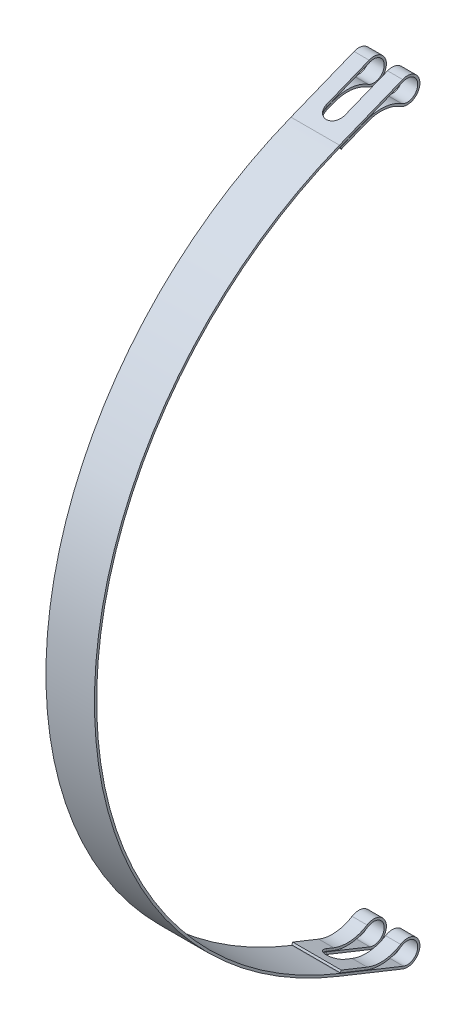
ISO-10303-21;
HEADER;
FILE_DESCRIPTION(('STEP AP214'),'2;1');
FILE_NAME('part.step','',(''),(''),'','','');
FILE_SCHEMA(('AUTOMOTIVE_DESIGN { 1 0 10303 214 1 1 1 1 }'));
ENDSEC;
DATA;
#1=APPLICATION_CONTEXT('core data for automotive mechanical design processes');
#2=APPLICATION_PROTOCOL_DEFINITION('international standard','automotive_design',2000,#1);
#3=PRODUCT_CONTEXT('',#1,'mechanical');
#4=PRODUCT('Part','Part','',(#3));
#5=PRODUCT_RELATED_PRODUCT_CATEGORY('part','',(#4));
#6=PRODUCT_DEFINITION_FORMATION('','',#4);
#7=PRODUCT_DEFINITION_CONTEXT('part definition',#1,'design');
#8=PRODUCT_DEFINITION('design','',#6,#7);
#9=PRODUCT_DEFINITION_SHAPE('','',#8);
#10=(LENGTH_UNIT() NAMED_UNIT(*) SI_UNIT(.MILLI.,.METRE.));
#11=(NAMED_UNIT(*) PLANE_ANGLE_UNIT() SI_UNIT($,.RADIAN.));
#12=(NAMED_UNIT(*) SI_UNIT($,.STERADIAN.) SOLID_ANGLE_UNIT());
#13=UNCERTAINTY_MEASURE_WITH_UNIT(LENGTH_MEASURE(1.E-05),#10,'distance_accuracy_value','');
#14=(GEOMETRIC_REPRESENTATION_CONTEXT(3) GLOBAL_UNCERTAINTY_ASSIGNED_CONTEXT((#13)) GLOBAL_UNIT_ASSIGNED_CONTEXT((#10,
#11,#12)) REPRESENTATION_CONTEXT('',''));
#15=CARTESIAN_POINT('',(0.,0.,0.));
#16=DIRECTION('',(0.,0.,1.));
#17=DIRECTION('',(1.,0.,0.));
#18=AXIS2_PLACEMENT_3D('',#15,#16,#17);
#19=CARTESIAN_POINT('',(16.6687500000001,-256.667437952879,50.8000000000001));
#20=DIRECTION('',(-1.,0.,0.));
#21=DIRECTION('',(0.,-1.,0.));
#22=AXIS2_PLACEMENT_3D('',#19,#20,#21);
#23=CYLINDRICAL_SURFACE('',#22,7.14374999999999);
#24=DIRECTION('',(-1.,0.,0.));
#25=VECTOR('',#24,1.);
#26=CARTESIAN_POINT('',(16.6687500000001,-263.298154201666,53.4583389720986));
#27=LINE('',#26,#25);
#28=CARTESIAN_POINT('',(-6.34999999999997,-263.298154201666,53.4583389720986));
#29=VERTEX_POINT('',#28);
#30=CARTESIAN_POINT('',(-16.66875,-263.298154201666,53.4583389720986));
#31=VERTEX_POINT('',#30);
#32=EDGE_CURVE('E396',#29,#31,#27,.T.);
#33=ORIENTED_EDGE('',*,*,#32,.F.);
#34=CARTESIAN_POINT('',(-6.34999999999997,-256.667437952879,50.8000000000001));
#35=DIRECTION('',(-1.,0.,0.));
#36=DIRECTION('',(0.,0.,1.));
#37=AXIS2_PLACEMENT_3D('',#34,#35,#36);
#38=CIRCLE('',#37,7.14374999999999);
#39=CARTESIAN_POINT('',(-6.34999999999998,-250.61801751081,54.599694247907));
#40=VERTEX_POINT('',#39);
#41=EDGE_CURVE('E313',#29,#40,#38,.F.);
#42=ORIENTED_EDGE('',*,*,#41,.T.);
#43=DIRECTION('',(-1.,0.,0.));
#44=VECTOR('',#43,1.);
#45=CARTESIAN_POINT('',(16.66875,-250.61801751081,54.599694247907));
#46=LINE('',#45,#44);
#47=CARTESIAN_POINT('',(-16.66875,-250.61801751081,54.599694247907));
#48=VERTEX_POINT('',#47);
#49=EDGE_CURVE('E391',#40,#48,#46,.T.);
#50=ORIENTED_EDGE('',*,*,#49,.T.);
#51=CARTESIAN_POINT('',(-16.66875,-256.667437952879,50.8000000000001));
#52=DIRECTION('',(-1.,0.,0.));
#53=DIRECTION('',(0.,1.,0.));
#54=AXIS2_PLACEMENT_3D('',#51,#52,#53);
#55=CIRCLE('',#54,7.14374999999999);
#56=EDGE_CURVE('E345',#48,#31,#55,.T.);
#57=ORIENTED_EDGE('',*,*,#56,.T.);
#58=EDGE_LOOP('',(#33,#42,#50,#57));
#59=FACE_BOUND('',#58,.T.);
#60=ADVANCED_FACE('F32',(#59),#23,.F.);
#61=CARTESIAN_POINT('',(16.6687500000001,-256.667437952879,50.8000000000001));
#62=DIRECTION('',(-1.,0.,0.));
#63=DIRECTION('',(0.,-1.,0.));
#64=AXIS2_PLACEMENT_3D('',#61,#62,#63);
#65=CYLINDRICAL_SURFACE('',#64,8.66775000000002);
#66=DIRECTION('',(-1.,0.,0.));
#67=VECTOR('',#66,1.);
#68=CARTESIAN_POINT('',(16.66875,-249.327474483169,55.4102956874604));
#69=LINE('',#68,#67);
#70=CARTESIAN_POINT('',(-6.34999999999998,-249.327474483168,55.4102956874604));
#71=VERTEX_POINT('',#70);
#72=CARTESIAN_POINT('',(-16.66875,-249.327474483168,55.4102956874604));
#73=VERTEX_POINT('',#72);
#74=EDGE_CURVE('E410',#71,#73,#69,.T.);
#75=ORIENTED_EDGE('',*,*,#74,.F.);
#76=CARTESIAN_POINT('',(-6.34999999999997,-256.667437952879,50.8000000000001));
#77=DIRECTION('',(-1.,0.,0.));
#78=DIRECTION('',(0.,0.,1.));
#79=AXIS2_PLACEMENT_3D('',#76,#77,#78);
#80=CIRCLE('',#79,8.66775000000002);
#81=CARTESIAN_POINT('',(-6.34999999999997,-264.712705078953,54.0254560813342));
#82=VERTEX_POINT('',#81);
#83=EDGE_CURVE('E332',#71,#82,#80,.T.);
#84=ORIENTED_EDGE('',*,*,#83,.T.);
#85=DIRECTION('',(-1.,0.,0.));
#86=VECTOR('',#85,1.);
#87=CARTESIAN_POINT('',(16.6687500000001,-264.712705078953,54.0254560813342));
#88=LINE('',#87,#86);
#89=CARTESIAN_POINT('',(-16.66875,-264.712705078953,54.0254560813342));
#90=VERTEX_POINT('',#89);
#91=EDGE_CURVE('E406',#82,#90,#88,.T.);
#92=ORIENTED_EDGE('',*,*,#91,.T.);
#93=CARTESIAN_POINT('',(-16.66875,-256.667437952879,50.8000000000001));
#94=DIRECTION('',(1.,0.,0.));
#95=DIRECTION('',(0.,1.,0.));
#96=AXIS2_PLACEMENT_3D('',#93,#94,#95);
#97=CIRCLE('',#96,8.66775000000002);
#98=EDGE_CURVE('E362',#90,#73,#97,.T.);
#99=ORIENTED_EDGE('',*,*,#98,.T.);
#100=EDGE_LOOP('',(#75,#84,#92,#99));
#101=FACE_BOUND('',#100,.T.);
#102=ADVANCED_FACE('F661',(#101),#65,.T.);
#103=CARTESIAN_POINT('',(16.66875,-227.818424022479,68.9203196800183));
#104=DIRECTION('',(-1.,0.,0.));
#105=DIRECTION('',(0.,-1.,0.));
#106=AXIS2_PLACEMENT_3D('',#103,#104,#105);
#107=CYLINDRICAL_SURFACE('',#106,25.4);
#108=DIRECTION('',(-1.,0.,0.));
#109=VECTOR('',#108,1.);
#110=CARTESIAN_POINT('',(16.6687500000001,-251.394304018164,78.3721915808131));
#111=LINE('',#110,#109);
#112=CARTESIAN_POINT('',(-6.34999999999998,-251.394304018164,78.3721915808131));
#113=VERTEX_POINT('',#112);
#114=CARTESIAN_POINT('',(-16.66875,-251.394304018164,78.3721915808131));
#115=VERTEX_POINT('',#114);
#116=EDGE_CURVE('E414',#113,#115,#111,.T.);
#117=ORIENTED_EDGE('',*,*,#116,.F.);
#118=CARTESIAN_POINT('',(-6.34999999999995,-227.818424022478,68.9203196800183));
#119=DIRECTION('',(-1.,0.,0.));
#120=DIRECTION('',(0.,0.,1.));
#121=AXIS2_PLACEMENT_3D('',#118,#119,#120);
#122=CIRCLE('',#121,25.4);
#123=EDGE_CURVE('E329',#113,#71,#122,.F.);
#124=ORIENTED_EDGE('',*,*,#123,.T.);
#125=ORIENTED_EDGE('',*,*,#74,.T.);
#126=CARTESIAN_POINT('',(-16.66875,-227.818424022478,68.9203196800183));
#127=DIRECTION('',(-1.,0.,0.));
#128=DIRECTION('',(0.,1.,0.));
#129=AXIS2_PLACEMENT_3D('',#126,#127,#128);
#130=CIRCLE('',#129,25.4);
#131=EDGE_CURVE('E359',#73,#115,#130,.T.);
#132=ORIENTED_EDGE('',*,*,#131,.T.);
#133=EDGE_LOOP('',(#117,#124,#125,#132));
#134=FACE_BOUND('',#133,.T.);
#135=ADVANCED_FACE('F656',(#134),#107,.F.);
#136=CARTESIAN_POINT('',(16.66875,-227.818424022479,68.9203196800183));
#137=DIRECTION('',(-1.,0.,0.));
#138=DIRECTION('',(0.,-1.,0.));
#139=AXIS2_PLACEMENT_3D('',#136,#137,#138);
#140=CYLINDRICAL_SURFACE('',#139,26.924);
#141=ORIENTED_EDGE('',*,*,#49,.F.);
#142=CARTESIAN_POINT('',(-6.34999999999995,-227.818424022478,68.9203196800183));
#143=DIRECTION('',(-1.,0.,0.));
#144=DIRECTION('',(0.,0.,1.));
#145=AXIS2_PLACEMENT_3D('',#142,#143,#144);
#146=CIRCLE('',#145,26.924);
#147=CARTESIAN_POINT('',(-6.34999999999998,-252.808856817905,78.9393038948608));
#148=VERTEX_POINT('',#147);
#149=EDGE_CURVE('E40',#40,#148,#146,.T.);
#150=ORIENTED_EDGE('',*,*,#149,.T.);
#151=DIRECTION('',(-1.,0.,0.));
#152=VECTOR('',#151,1.);
#153=CARTESIAN_POINT('',(16.6687500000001,-252.808856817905,78.9393038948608));
#154=LINE('',#153,#152);
#155=CARTESIAN_POINT('',(-16.66875,-252.808856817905,78.9393038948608));
#156=VERTEX_POINT('',#155);
#157=EDGE_CURVE('E310',#148,#156,#154,.T.);
#158=ORIENTED_EDGE('',*,*,#157,.T.);
#159=CARTESIAN_POINT('',(-16.66875,-227.818424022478,68.9203196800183));
#160=DIRECTION('',(1.,0.,0.));
#161=DIRECTION('',(0.,1.,0.));
#162=AXIS2_PLACEMENT_3D('',#159,#160,#161);
#163=CIRCLE('',#162,26.924);
#164=EDGE_CURVE('E348',#156,#48,#163,.T.);
#165=ORIENTED_EDGE('',*,*,#164,.T.);
#166=EDGE_LOOP('',(#141,#150,#158,#165));
#167=FACE_BOUND('',#166,.T.);
#168=ADVANCED_FACE('F587',(#167),#140,.T.);
#169=CARTESIAN_POINT('',(16.66875,-250.61801751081,54.599694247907));
#170=VERTEX_POINT('',#169);
#171=CARTESIAN_POINT('',(6.35000000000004,-250.61801751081,54.599694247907));
#172=VERTEX_POINT('',#171);
#173=EDGE_CURVE('E421',#170,#172,#46,.T.);
#174=ORIENTED_EDGE('',*,*,#173,.T.);
#175=CARTESIAN_POINT('',(6.35000000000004,-256.667437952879,50.8000000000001));
#176=DIRECTION('',(1.,0.,0.));
#177=DIRECTION('',(0.,0.,-1.));
#178=AXIS2_PLACEMENT_3D('',#175,#176,#177);
#179=CIRCLE('',#178,7.14374999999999);
#180=CARTESIAN_POINT('',(6.35000000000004,-263.298154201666,53.4583389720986));
#181=VERTEX_POINT('',#180);
#182=EDGE_CURVE('E54',#172,#181,#179,.F.);
#183=ORIENTED_EDGE('',*,*,#182,.T.);
#184=CARTESIAN_POINT('',(16.6687500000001,-263.298154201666,53.4583389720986));
#185=VERTEX_POINT('',#184);
#186=EDGE_CURVE('E392',#185,#181,#27,.T.);
#187=ORIENTED_EDGE('',*,*,#186,.F.);
#188=CARTESIAN_POINT('',(16.6687500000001,-256.667437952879,50.8000000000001));
#189=DIRECTION('',(-1.,0.,0.));
#190=DIRECTION('',(0.,1.,0.));
#191=AXIS2_PLACEMENT_3D('',#188,#189,#190);
#192=CIRCLE('',#191,7.14374999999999);
#193=EDGE_CURVE('E371',#170,#185,#192,.T.);
#194=ORIENTED_EDGE('',*,*,#193,.F.);
#195=EDGE_LOOP('',(#174,#183,#187,#194));
#196=FACE_BOUND('',#195,.T.);
#197=ADVANCED_FACE('F636',(#196),#23,.F.);
#198=CARTESIAN_POINT('',(16.6687500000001,-245.897267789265,96.8615097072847));
#199=DIRECTION('',(0.,-0.928184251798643,0.372120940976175));
#200=DIRECTION('',(0.,-0.372120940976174,-0.928184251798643));
#201=AXIS2_PLACEMENT_3D('',#198,#199,#200);
#202=PLANE('',#201);
#203=CARTESIAN_POINT('',(0.,-251.291252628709,83.4072499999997));
#204=DIRECTION('',(0.,-0.928184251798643,0.372120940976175));
#205=DIRECTION('',(0.,-0.372120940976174,-0.928184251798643));
#206=AXIS2_PLACEMENT_3D('',#203,#204,#205);
#207=ELLIPSE('',#206,6.841314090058,6.35);
#208=CARTESIAN_POINT('',(6.35000000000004,-251.291252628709,83.4072499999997));
#209=VERTEX_POINT('',#208);
#210=CARTESIAN_POINT('',(-6.34999999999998,-251.291252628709,83.4072499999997));
#211=VERTEX_POINT('',#210);
#212=EDGE_CURVE('E342',#209,#211,#207,.T.);
#213=ORIENTED_EDGE('',*,*,#212,.T.);
#214=DIRECTION('',(0.,-0.372120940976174,-0.928184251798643));
#215=VECTOR('',#214,1.);
#216=CARTESIAN_POINT('',(-6.34999999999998,-245.897267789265,96.8615097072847));
#217=LINE('',#216,#215);
#218=EDGE_CURVE('E317',#211,#29,#217,.T.);
#219=ORIENTED_EDGE('',*,*,#218,.T.);
#220=ORIENTED_EDGE('',*,*,#32,.T.);
#221=DIRECTION('',(0.,0.372120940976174,0.928184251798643));
#222=VECTOR('',#221,1.);
#223=CARTESIAN_POINT('',(-16.66875,-245.897267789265,96.8615097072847));
#224=LINE('',#223,#222);
#225=CARTESIAN_POINT('',(-16.66875,-245.897267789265,96.8615097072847));
#226=VERTEX_POINT('',#225);
#227=EDGE_CURVE('E368',#31,#226,#224,.T.);
#228=ORIENTED_EDGE('',*,*,#227,.T.);
#229=DIRECTION('',(-1.,0.,0.));
#230=VECTOR('',#229,1.);
#231=CARTESIAN_POINT('',(16.6687500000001,-245.897267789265,96.8615097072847));
#232=LINE('',#231,#230);
#233=CARTESIAN_POINT('',(16.6687500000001,-245.897267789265,96.8615097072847));
#234=VERTEX_POINT('',#233);
#235=EDGE_CURVE('E397',#234,#226,#232,.T.);
#236=ORIENTED_EDGE('',*,*,#235,.F.);
#237=DIRECTION('',(0.,0.372120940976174,0.928184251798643));
#238=VECTOR('',#237,1.);
#239=CARTESIAN_POINT('',(16.6687500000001,-245.897267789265,96.8615097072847));
#240=LINE('',#239,#238);
#241=EDGE_CURVE('E388',#185,#234,#240,.T.);
#242=ORIENTED_EDGE('',*,*,#241,.F.);
#243=ORIENTED_EDGE('',*,*,#186,.T.);
#244=DIRECTION('',(0.,0.372120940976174,0.928184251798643));
#245=VECTOR('',#244,1.);
#246=CARTESIAN_POINT('',(6.35000000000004,-245.897267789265,96.8615097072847));
#247=LINE('',#246,#245);
#248=EDGE_CURVE('E606',#181,#209,#247,.T.);
#249=ORIENTED_EDGE('',*,*,#248,.T.);
#250=EDGE_LOOP('',(#213,#219,#220,#228,#236,#242,#243,#249));
#251=FACE_BOUND('',#250,.T.);
#252=ADVANCED_FACE('F595',(#251),#202,.F.);
#253=CARTESIAN_POINT('',(16.6687500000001,-247.31522416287,97.4200575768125));
#254=DIRECTION('',(0.,0.928184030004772,-0.372121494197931));
#255=DIRECTION('',(0.,0.37212149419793,0.928184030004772));
#256=AXIS2_PLACEMENT_3D('',#253,#254,#255);
#257=PLANE('',#256);
#258=ORIENTED_EDGE('',*,*,#91,.F.);
#259=DIRECTION('',(0.,0.37212149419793,0.928184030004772));
#260=VECTOR('',#259,1.);
#261=CARTESIAN_POINT('',(-6.34999999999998,-247.31522416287,97.4200575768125));
#262=LINE('',#261,#260);
#263=CARTESIAN_POINT('',(-6.34999999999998,-252.933147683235,83.4072499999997));
#264=VERTEX_POINT('',#263);
#265=EDGE_CURVE('E335',#82,#264,#262,.T.);
#266=ORIENTED_EDGE('',*,*,#265,.T.);
#267=CARTESIAN_POINT('',(0.,-252.933147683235,83.4072499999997));
#268=DIRECTION('',(0.,0.928184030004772,-0.372121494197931));
#269=DIRECTION('',(0.,-0.37212149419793,-0.928184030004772));
#270=AXIS2_PLACEMENT_3D('',#267,#268,#269);
#271=ELLIPSE('',#270,6.84131572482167,6.35);
#272=CARTESIAN_POINT('',(6.35000000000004,-252.933147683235,83.4072499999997));
#273=VERTEX_POINT('',#272);
#274=EDGE_CURVE('E339',#264,#273,#271,.T.);
#275=ORIENTED_EDGE('',*,*,#274,.T.);
#276=DIRECTION('',(0.,-0.37212149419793,-0.928184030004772));
#277=VECTOR('',#276,1.);
#278=CARTESIAN_POINT('',(6.35000000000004,-247.31522416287,97.4200575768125));
#279=LINE('',#278,#277);
#280=CARTESIAN_POINT('',(6.35000000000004,-264.712705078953,54.0254560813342));
#281=VERTEX_POINT('',#280);
#282=EDGE_CURVE('E314',#273,#281,#279,.T.);
#283=ORIENTED_EDGE('',*,*,#282,.T.);
#284=CARTESIAN_POINT('',(16.6687500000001,-264.712705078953,54.0254560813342));
#285=VERTEX_POINT('',#284);
#286=EDGE_CURVE('E403',#285,#281,#88,.T.);
#287=ORIENTED_EDGE('',*,*,#286,.F.);
#288=DIRECTION('',(0.,-0.37212149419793,-0.928184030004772));
#289=VECTOR('',#288,1.);
#290=CARTESIAN_POINT('',(16.6687500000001,-247.31522416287,97.4200575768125));
#291=LINE('',#290,#289);
#292=CARTESIAN_POINT('',(16.6687500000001,-247.31522416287,97.4200575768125));
#293=VERTEX_POINT('',#292);
#294=EDGE_CURVE('E386',#293,#285,#291,.T.);
#295=ORIENTED_EDGE('',*,*,#294,.F.);
#296=DIRECTION('',(-1.,0.,0.));
#297=VECTOR('',#296,1.);
#298=CARTESIAN_POINT('',(16.6687500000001,-247.31522416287,97.4200575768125));
#299=LINE('',#298,#297);
#300=CARTESIAN_POINT('',(-16.66875,-247.31522416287,97.4200575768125));
#301=VERTEX_POINT('',#300);
#302=EDGE_CURVE('E400',#293,#301,#299,.T.);
#303=ORIENTED_EDGE('',*,*,#302,.T.);
#304=DIRECTION('',(0.,-0.37212149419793,-0.928184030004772));
#305=VECTOR('',#304,1.);
#306=CARTESIAN_POINT('',(-16.66875,-247.31522416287,97.4200575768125));
#307=LINE('',#306,#305);
#308=EDGE_CURVE('E365',#301,#90,#307,.T.);
#309=ORIENTED_EDGE('',*,*,#308,.T.);
#310=EDGE_LOOP('',(#258,#266,#275,#283,#287,#295,#303,#309));
#311=FACE_BOUND('',#310,.T.);
#312=ADVANCED_FACE('F632',(#311),#257,.F.);
#313=ORIENTED_EDGE('',*,*,#286,.T.);
#314=CARTESIAN_POINT('',(6.35000000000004,-256.667437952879,50.8000000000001));
#315=DIRECTION('',(1.,0.,0.));
#316=DIRECTION('',(0.,0.,-1.));
#317=AXIS2_PLACEMENT_3D('',#314,#315,#316);
#318=CIRCLE('',#317,8.66775000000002);
#319=CARTESIAN_POINT('',(6.35000000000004,-249.327474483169,55.4102956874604));
#320=VERTEX_POINT('',#319);
#321=EDGE_CURVE('E320',#281,#320,#318,.T.);
#322=ORIENTED_EDGE('',*,*,#321,.T.);
#323=CARTESIAN_POINT('',(16.66875,-249.327474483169,55.4102956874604));
#324=VERTEX_POINT('',#323);
#325=EDGE_CURVE('E407',#324,#320,#69,.T.);
#326=ORIENTED_EDGE('',*,*,#325,.F.);
#327=CARTESIAN_POINT('',(16.6687500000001,-256.667437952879,50.8000000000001));
#328=DIRECTION('',(1.,0.,0.));
#329=DIRECTION('',(0.,1.,0.));
#330=AXIS2_PLACEMENT_3D('',#327,#328,#329);
#331=CIRCLE('',#330,8.66775000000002);
#332=EDGE_CURVE('E384',#285,#324,#331,.T.);
#333=ORIENTED_EDGE('',*,*,#332,.F.);
#334=EDGE_LOOP('',(#313,#322,#326,#333));
#335=FACE_BOUND('',#334,.T.);
#336=ADVANCED_FACE('F615',(#335),#65,.T.);
#337=CARTESIAN_POINT('',(16.66875,256.667437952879,50.7999999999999));
#338=DIRECTION('',(-1.,0.,0.));
#339=DIRECTION('',(0.,-1.,0.));
#340=AXIS2_PLACEMENT_3D('',#337,#338,#339);
#341=CYLINDRICAL_SURFACE('',#340,7.14374999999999);
#342=DIRECTION('',(-1.,0.,0.));
#343=VECTOR('',#342,1.);
#344=CARTESIAN_POINT('',(16.66875,263.298154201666,53.4583389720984));
#345=LINE('',#344,#343);
#346=CARTESIAN_POINT('',(16.66875,263.298154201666,53.4583389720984));
#347=VERTEX_POINT('',#346);
#348=CARTESIAN_POINT('',(6.35000000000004,263.298154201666,53.4583389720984));
#349=VERTEX_POINT('',#348);
#350=EDGE_CURVE('E574',#347,#349,#345,.T.);
#351=ORIENTED_EDGE('',*,*,#350,.T.);
#352=CARTESIAN_POINT('',(6.35000000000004,256.667437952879,50.7999999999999));
#353=DIRECTION('',(-1.,0.,0.));
#354=DIRECTION('',(0.,0.,1.));
#355=AXIS2_PLACEMENT_3D('',#352,#353,#354);
#356=CIRCLE('',#355,7.14374999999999);
#357=CARTESIAN_POINT('',(6.35000000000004,250.61801751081,54.5996942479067));
#358=VERTEX_POINT('',#357);
#359=EDGE_CURVE('E460',#349,#358,#356,.T.);
#360=ORIENTED_EDGE('',*,*,#359,.T.);
#361=DIRECTION('',(-1.,0.,0.));
#362=VECTOR('',#361,1.);
#363=CARTESIAN_POINT('',(16.66875,250.61801751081,54.5996942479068));
#364=LINE('',#363,#362);
#365=CARTESIAN_POINT('',(16.66875,250.61801751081,54.5996942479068));
#366=VERTEX_POINT('',#365);
#367=EDGE_CURVE('E545',#366,#358,#364,.T.);
#368=ORIENTED_EDGE('',*,*,#367,.F.);
#369=CARTESIAN_POINT('',(16.66875,256.667437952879,50.7999999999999));
#370=DIRECTION('',(1.,0.,0.));
#371=DIRECTION('',(0.,-1.,0.));
#372=AXIS2_PLACEMENT_3D('',#369,#370,#371);
#373=CIRCLE('',#372,7.14374999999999);
#374=EDGE_CURVE('E512',#366,#347,#373,.T.);
#375=ORIENTED_EDGE('',*,*,#374,.T.);
#376=EDGE_LOOP('',(#351,#360,#368,#375));
#377=FACE_BOUND('',#376,.T.);
#378=ADVANCED_FACE('F34',(#377),#341,.F.);
#379=CARTESIAN_POINT('',(-6.34999999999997,250.61801751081,54.5996942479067));
#380=VERTEX_POINT('',#379);
#381=CARTESIAN_POINT('',(-16.66875,250.61801751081,54.5996942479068));
#382=VERTEX_POINT('',#381);
#383=EDGE_CURVE('E549',#380,#382,#364,.T.);
#384=ORIENTED_EDGE('',*,*,#383,.F.);
#385=CARTESIAN_POINT('',(-6.34999999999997,256.667437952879,50.7999999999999));
#386=DIRECTION('',(1.,0.,0.));
#387=DIRECTION('',(0.,0.,-1.));
#388=AXIS2_PLACEMENT_3D('',#385,#386,#387);
#389=CIRCLE('',#388,7.14374999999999);
#390=CARTESIAN_POINT('',(-6.34999999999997,263.298154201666,53.4583389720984));
#391=VERTEX_POINT('',#390);
#392=EDGE_CURVE('E431',#380,#391,#389,.T.);
#393=ORIENTED_EDGE('',*,*,#392,.T.);
#394=CARTESIAN_POINT('',(-16.66875,263.298154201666,53.4583389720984));
#395=VERTEX_POINT('',#394);
#396=EDGE_CURVE('E544',#391,#395,#345,.T.);
#397=ORIENTED_EDGE('',*,*,#396,.T.);
#398=CARTESIAN_POINT('',(-16.66875,256.667437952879,50.7999999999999));
#399=DIRECTION('',(1.,0.,0.));
#400=DIRECTION('',(0.,-1.,0.));
#401=AXIS2_PLACEMENT_3D('',#398,#399,#400);
#402=CIRCLE('',#401,7.14374999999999);
#403=EDGE_CURVE('E480',#382,#395,#402,.T.);
#404=ORIENTED_EDGE('',*,*,#403,.F.);
#405=EDGE_LOOP('',(#384,#393,#397,#404));
#406=FACE_BOUND('',#405,.T.);
#407=ADVANCED_FACE('F953',(#406),#341,.F.);
#408=CARTESIAN_POINT('',(16.6687500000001,227.818424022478,68.920319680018));
#409=DIRECTION('',(-1.,0.,0.));
#410=DIRECTION('',(0.,-1.,0.));
#411=AXIS2_PLACEMENT_3D('',#408,#409,#410);
#412=CYLINDRICAL_SURFACE('',#411,26.924);
#413=ORIENTED_EDGE('',*,*,#367,.T.);
#414=CARTESIAN_POINT('',(6.35000000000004,227.818424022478,68.920319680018));
#415=DIRECTION('',(-1.,0.,0.));
#416=DIRECTION('',(0.,0.,1.));
#417=AXIS2_PLACEMENT_3D('',#414,#415,#416);
#418=CIRCLE('',#417,26.924);
#419=CARTESIAN_POINT('',(6.35000000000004,252.808856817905,78.9393038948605));
#420=VERTEX_POINT('',#419);
#421=EDGE_CURVE('E463',#358,#420,#418,.F.);
#422=ORIENTED_EDGE('',*,*,#421,.T.);
#423=DIRECTION('',(-1.,0.,0.));
#424=VECTOR('',#423,1.);
#425=CARTESIAN_POINT('',(16.66875,252.808856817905,78.9393038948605));
#426=LINE('',#425,#424);
#427=CARTESIAN_POINT('',(16.66875,252.808856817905,78.9393038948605));
#428=VERTEX_POINT('',#427);
#429=EDGE_CURVE('E550',#428,#420,#426,.T.);
#430=ORIENTED_EDGE('',*,*,#429,.F.);
#431=CARTESIAN_POINT('',(16.6687500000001,227.818424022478,68.920319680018));
#432=DIRECTION('',(-1.,0.,0.));
#433=DIRECTION('',(0.,-1.,0.));
#434=AXIS2_PLACEMENT_3D('',#431,#432,#433);
#435=CIRCLE('',#434,26.924);
#436=EDGE_CURVE('E541',#428,#366,#435,.T.);
#437=ORIENTED_EDGE('',*,*,#436,.T.);
#438=EDGE_LOOP('',(#413,#422,#430,#437));
#439=FACE_BOUND('',#438,.T.);
#440=ADVANCED_FACE('F691',(#439),#412,.T.);
#441=CARTESIAN_POINT('',(-6.34999999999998,252.808856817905,78.9393038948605));
#442=VERTEX_POINT('',#441);
#443=CARTESIAN_POINT('',(-16.66875,252.808856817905,78.9393038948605));
#444=VERTEX_POINT('',#443);
#445=EDGE_CURVE('E553',#442,#444,#426,.T.);
#446=ORIENTED_EDGE('',*,*,#445,.F.);
#447=CARTESIAN_POINT('',(-6.34999999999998,227.818424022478,68.920319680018));
#448=DIRECTION('',(1.,0.,0.));
#449=DIRECTION('',(0.,0.,-1.));
#450=AXIS2_PLACEMENT_3D('',#447,#448,#449);
#451=CIRCLE('',#450,26.924);
#452=EDGE_CURVE('E434',#442,#380,#451,.F.);
#453=ORIENTED_EDGE('',*,*,#452,.T.);
#454=ORIENTED_EDGE('',*,*,#383,.T.);
#455=CARTESIAN_POINT('',(-16.66875,227.818424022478,68.920319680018));
#456=DIRECTION('',(-1.,0.,0.));
#457=DIRECTION('',(0.,-1.,0.));
#458=AXIS2_PLACEMENT_3D('',#455,#456,#457);
#459=CIRCLE('',#458,26.924);
#460=EDGE_CURVE('E509',#444,#382,#459,.T.);
#461=ORIENTED_EDGE('',*,*,#460,.F.);
#462=EDGE_LOOP('',(#446,#453,#454,#461));
#463=FACE_BOUND('',#462,.T.);
#464=ADVANCED_FACE('F935',(#463),#412,.T.);
#465=CARTESIAN_POINT('',(16.6687500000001,245.660937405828,96.7684166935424));
#466=DIRECTION('',(0.,0.928184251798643,0.372120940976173));
#467=DIRECTION('',(0.,-0.372120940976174,0.928184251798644));
#468=AXIS2_PLACEMENT_3D('',#465,#466,#467);
#469=PLANE('',#468);
#470=ORIENTED_EDGE('',*,*,#429,.T.);
#471=DIRECTION('',(0.,-0.372120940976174,0.928184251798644));
#472=VECTOR('',#471,1.);
#473=CARTESIAN_POINT('',(6.35000000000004,245.660937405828,96.7684166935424));
#474=LINE('',#473,#472);
#475=CARTESIAN_POINT('',(6.35000000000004,251.017600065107,83.4072499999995));
#476=VERTEX_POINT('',#475);
#477=EDGE_CURVE('E466',#420,#476,#474,.T.);
#478=ORIENTED_EDGE('',*,*,#477,.T.);
#479=CARTESIAN_POINT('',(0.,251.017600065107,83.4072499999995));
#480=DIRECTION('',(0.,0.928184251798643,0.372120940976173));
#481=DIRECTION('',(0.,0.372120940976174,-0.928184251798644));
#482=AXIS2_PLACEMENT_3D('',#479,#480,#481);
#483=ELLIPSE('',#482,6.841314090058,6.35);
#484=CARTESIAN_POINT('',(-6.34999999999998,251.017600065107,83.4072499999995));
#485=VERTEX_POINT('',#484);
#486=EDGE_CURVE('E457',#476,#485,#483,.F.);
#487=ORIENTED_EDGE('',*,*,#486,.T.);
#488=DIRECTION('',(0.,0.372120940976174,-0.928184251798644));
#489=VECTOR('',#488,1.);
#490=CARTESIAN_POINT('',(-6.34999999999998,245.660937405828,96.7684166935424));
#491=LINE('',#490,#489);
#492=EDGE_CURVE('E437',#485,#442,#491,.T.);
#493=ORIENTED_EDGE('',*,*,#492,.T.);
#494=ORIENTED_EDGE('',*,*,#445,.T.);
#495=DIRECTION('',(0.,0.372120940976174,-0.928184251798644));
#496=VECTOR('',#495,1.);
#497=CARTESIAN_POINT('',(-16.66875,245.660937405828,96.7684166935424));
#498=LINE('',#497,#496);
#499=CARTESIAN_POINT('',(-16.66875,245.660937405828,96.7684166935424));
#500=VERTEX_POINT('',#499);
#501=EDGE_CURVE('E506',#500,#444,#498,.T.);
#502=ORIENTED_EDGE('',*,*,#501,.F.);
#503=DIRECTION('',(-1.,0.,0.));
#504=VECTOR('',#503,1.);
#505=CARTESIAN_POINT('',(16.6687500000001,245.660937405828,96.7684166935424));
#506=LINE('',#505,#504);
#507=CARTESIAN_POINT('',(16.6687500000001,245.660937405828,96.7684166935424));
#508=VERTEX_POINT('',#507);
#509=EDGE_CURVE('E554',#508,#500,#506,.T.);
#510=ORIENTED_EDGE('',*,*,#509,.F.);
#511=DIRECTION('',(0.,0.372120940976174,-0.928184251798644));
#512=VECTOR('',#511,1.);
#513=CARTESIAN_POINT('',(16.6687500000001,245.660937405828,96.7684166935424));
#514=LINE('',#513,#512);
#515=EDGE_CURVE('E538',#508,#428,#514,.T.);
#516=ORIENTED_EDGE('',*,*,#515,.T.);
#517=EDGE_LOOP('',(#470,#478,#487,#493,#494,#502,#510,#516));
#518=FACE_BOUND('',#517,.T.);
#519=ADVANCED_FACE('F686',(#518),#469,.T.);
#520=CARTESIAN_POINT('',(16.6687500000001,244.242955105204,96.2098586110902));
#521=DIRECTION('',(0.,-0.928184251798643,-0.372120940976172));
#522=DIRECTION('',(0.,0.372120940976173,-0.928184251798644));
#523=AXIS2_PLACEMENT_3D('',#520,#521,#522);
#524=PLANE('',#523);
#525=CARTESIAN_POINT('',(0.,249.375684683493,83.4072499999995));
#526=DIRECTION('',(0.,-0.928184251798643,-0.372120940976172));
#527=DIRECTION('',(0.,0.372120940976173,-0.928184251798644));
#528=AXIS2_PLACEMENT_3D('',#525,#526,#527);
#529=ELLIPSE('',#528,6.841314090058,6.35);
#530=CARTESIAN_POINT('',(-6.34999999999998,249.375684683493,83.4072499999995));
#531=VERTEX_POINT('',#530);
#532=CARTESIAN_POINT('',(6.35000000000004,249.375684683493,83.4072499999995));
#533=VERTEX_POINT('',#532);
#534=EDGE_CURVE('E454',#531,#533,#529,.F.);
#535=ORIENTED_EDGE('',*,*,#534,.T.);
#536=DIRECTION('',(0.,0.372120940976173,-0.928184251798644));
#537=VECTOR('',#536,1.);
#538=CARTESIAN_POINT('',(6.35000000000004,244.242955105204,96.2098586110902));
#539=LINE('',#538,#537);
#540=CARTESIAN_POINT('',(6.35000000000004,251.394304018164,78.3721915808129));
#541=VERTEX_POINT('',#540);
#542=EDGE_CURVE('E477',#533,#541,#539,.T.);
#543=ORIENTED_EDGE('',*,*,#542,.T.);
#544=DIRECTION('',(-1.,0.,0.));
#545=VECTOR('',#544,1.);
#546=CARTESIAN_POINT('',(16.66875,251.394304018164,78.3721915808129));
#547=LINE('',#546,#545);
#548=CARTESIAN_POINT('',(16.66875,251.394304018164,78.3721915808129));
#549=VERTEX_POINT('',#548);
#550=EDGE_CURVE('E558',#549,#541,#547,.T.);
#551=ORIENTED_EDGE('',*,*,#550,.F.);
#552=DIRECTION('',(0.,-0.372120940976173,0.928184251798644));
#553=VECTOR('',#552,1.);
#554=CARTESIAN_POINT('',(16.6687500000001,244.242955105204,96.2098586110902));
#555=LINE('',#554,#553);
#556=CARTESIAN_POINT('',(16.6687500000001,244.242955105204,96.2098586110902));
#557=VERTEX_POINT('',#556);
#558=EDGE_CURVE('E532',#549,#557,#555,.T.);
#559=ORIENTED_EDGE('',*,*,#558,.T.);
#560=DIRECTION('',(-1.,0.,0.));
#561=VECTOR('',#560,1.);
#562=CARTESIAN_POINT('',(16.6687500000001,244.242955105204,96.2098586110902));
#563=LINE('',#562,#561);
#564=CARTESIAN_POINT('',(-16.66875,244.242955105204,96.2098586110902));
#565=VERTEX_POINT('',#564);
#566=EDGE_CURVE('E556',#557,#565,#563,.T.);
#567=ORIENTED_EDGE('',*,*,#566,.T.);
#568=DIRECTION('',(0.,-0.372120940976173,0.928184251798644));
#569=VECTOR('',#568,1.);
#570=CARTESIAN_POINT('',(-16.66875,244.242955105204,96.2098586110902));
#571=LINE('',#570,#569);
#572=CARTESIAN_POINT('',(-16.66875,251.394304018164,78.3721915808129));
#573=VERTEX_POINT('',#572);
#574=EDGE_CURVE('E500',#573,#565,#571,.T.);
#575=ORIENTED_EDGE('',*,*,#574,.F.);
#576=CARTESIAN_POINT('',(-6.34999999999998,251.394304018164,78.3721915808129));
#577=VERTEX_POINT('',#576);
#578=EDGE_CURVE('E561',#577,#573,#547,.T.);
#579=ORIENTED_EDGE('',*,*,#578,.F.);
#580=DIRECTION('',(0.,-0.372120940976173,0.928184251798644));
#581=VECTOR('',#580,1.);
#582=CARTESIAN_POINT('',(-6.34999999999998,244.242955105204,96.2098586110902));
#583=LINE('',#582,#581);
#584=EDGE_CURVE('E448',#577,#531,#583,.T.);
#585=ORIENTED_EDGE('',*,*,#584,.T.);
#586=EDGE_LOOP('',(#535,#543,#551,#559,#567,#575,#579,#585));
#587=FACE_BOUND('',#586,.T.);
#588=ADVANCED_FACE('F678',(#587),#524,.T.);
#589=CARTESIAN_POINT('',(16.6687500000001,227.818424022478,68.920319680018));
#590=DIRECTION('',(-1.,0.,0.));
#591=DIRECTION('',(0.,-1.,0.));
#592=AXIS2_PLACEMENT_3D('',#589,#590,#591);
#593=CYLINDRICAL_SURFACE('',#592,25.4);
#594=ORIENTED_EDGE('',*,*,#550,.T.);
#595=CARTESIAN_POINT('',(6.35000000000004,227.818424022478,68.920319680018));
#596=DIRECTION('',(-1.,0.,0.));
#597=DIRECTION('',(0.,0.,1.));
#598=AXIS2_PLACEMENT_3D('',#595,#596,#597);
#599=CIRCLE('',#598,25.4);
#600=CARTESIAN_POINT('',(6.35000000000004,249.327474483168,55.4102956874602));
#601=VERTEX_POINT('',#600);
#602=EDGE_CURVE('E474',#541,#601,#599,.T.);
#603=ORIENTED_EDGE('',*,*,#602,.T.);
#604=DIRECTION('',(-1.,0.,0.));
#605=VECTOR('',#604,1.);
#606=CARTESIAN_POINT('',(16.66875,249.327474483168,55.4102956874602));
#607=LINE('',#606,#605);
#608=CARTESIAN_POINT('',(16.66875,249.327474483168,55.4102956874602));
#609=VERTEX_POINT('',#608);
#610=EDGE_CURVE('E562',#609,#601,#607,.T.);
#611=ORIENTED_EDGE('',*,*,#610,.F.);
#612=CARTESIAN_POINT('',(16.6687500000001,227.818424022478,68.920319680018));
#613=DIRECTION('',(1.,0.,0.));
#614=DIRECTION('',(0.,-1.,0.));
#615=AXIS2_PLACEMENT_3D('',#612,#613,#614);
#616=CIRCLE('',#615,25.4);
#617=EDGE_CURVE('E529',#609,#549,#616,.T.);
#618=ORIENTED_EDGE('',*,*,#617,.T.);
#619=EDGE_LOOP('',(#594,#603,#611,#618));
#620=FACE_BOUND('',#619,.T.);
#621=ADVANCED_FACE('F701',(#620),#593,.F.);
#622=CARTESIAN_POINT('',(-6.34999999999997,249.327474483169,55.4102956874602));
#623=VERTEX_POINT('',#622);
#624=CARTESIAN_POINT('',(-16.66875,249.327474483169,55.4102956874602));
#625=VERTEX_POINT('',#624);
#626=EDGE_CURVE('E565',#623,#625,#607,.T.);
#627=ORIENTED_EDGE('',*,*,#626,.F.);
#628=CARTESIAN_POINT('',(-6.34999999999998,227.818424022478,68.920319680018));
#629=DIRECTION('',(1.,0.,0.));
#630=DIRECTION('',(0.,0.,-1.));
#631=AXIS2_PLACEMENT_3D('',#628,#629,#630);
#632=CIRCLE('',#631,25.4);
#633=EDGE_CURVE('E445',#623,#577,#632,.T.);
#634=ORIENTED_EDGE('',*,*,#633,.T.);
#635=ORIENTED_EDGE('',*,*,#578,.T.);
#636=CARTESIAN_POINT('',(-16.66875,227.818424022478,68.920319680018));
#637=DIRECTION('',(1.,0.,0.));
#638=DIRECTION('',(0.,-1.,0.));
#639=AXIS2_PLACEMENT_3D('',#636,#637,#638);
#640=CIRCLE('',#639,25.4);
#641=EDGE_CURVE('E497',#625,#573,#640,.T.);
#642=ORIENTED_EDGE('',*,*,#641,.F.);
#643=EDGE_LOOP('',(#627,#634,#635,#642));
#644=FACE_BOUND('',#643,.T.);
#645=ADVANCED_FACE('F675',(#644),#593,.F.);
#646=CARTESIAN_POINT('',(16.66875,256.667437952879,50.7999999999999));
#647=DIRECTION('',(-1.,0.,0.));
#648=DIRECTION('',(0.,-1.,0.));
#649=AXIS2_PLACEMENT_3D('',#646,#647,#648);
#650=CYLINDRICAL_SURFACE('',#649,8.66775000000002);
#651=CARTESIAN_POINT('',(6.35000000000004,256.667437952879,50.7999999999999));
#652=DIRECTION('',(-1.,0.,0.));
#653=DIRECTION('',(0.,0.,1.));
#654=AXIS2_PLACEMENT_3D('',#651,#652,#653);
#655=CIRCLE('',#654,8.66775000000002);
#656=CARTESIAN_POINT('',(6.35000000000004,264.712705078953,54.0254560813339));
#657=VERTEX_POINT('',#656);
#658=EDGE_CURVE('E472',#601,#657,#655,.F.);
#659=ORIENTED_EDGE('',*,*,#658,.T.);
#660=DIRECTION('',(-1.,0.,0.));
#661=VECTOR('',#660,1.);
#662=CARTESIAN_POINT('',(16.66875,264.712705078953,54.0254560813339));
#663=LINE('',#662,#661);
#664=CARTESIAN_POINT('',(16.66875,264.712705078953,54.0254560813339));
#665=VERTEX_POINT('',#664);
#666=EDGE_CURVE('E566',#665,#657,#663,.T.);
#667=ORIENTED_EDGE('',*,*,#666,.F.);
#668=CARTESIAN_POINT('',(16.66875,256.667437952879,50.7999999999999));
#669=DIRECTION('',(-1.,0.,0.));
#670=DIRECTION('',(0.,-1.,0.));
#671=AXIS2_PLACEMENT_3D('',#668,#669,#670);
#672=CIRCLE('',#671,8.66775000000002);
#673=EDGE_CURVE('E526',#665,#609,#672,.T.);
#674=ORIENTED_EDGE('',*,*,#673,.T.);
#675=ORIENTED_EDGE('',*,*,#610,.T.);
#676=EDGE_LOOP('',(#659,#667,#674,#675));
#677=FACE_BOUND('',#676,.T.);
#678=ADVANCED_FACE('F705',(#677),#650,.T.);
#679=CARTESIAN_POINT('',(-6.34999999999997,264.712705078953,54.0254560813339));
#680=VERTEX_POINT('',#679);
#681=CARTESIAN_POINT('',(-16.66875,264.712705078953,54.0254560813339));
#682=VERTEX_POINT('',#681);
#683=EDGE_CURVE('E569',#680,#682,#663,.T.);
#684=ORIENTED_EDGE('',*,*,#683,.F.);
#685=CARTESIAN_POINT('',(-6.34999999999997,256.667437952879,50.7999999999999));
#686=DIRECTION('',(1.,0.,0.));
#687=DIRECTION('',(0.,0.,-1.));
#688=AXIS2_PLACEMENT_3D('',#685,#686,#687);
#689=CIRCLE('',#688,8.66775000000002);
#690=EDGE_CURVE('E443',#680,#623,#689,.F.);
#691=ORIENTED_EDGE('',*,*,#690,.T.);
#692=ORIENTED_EDGE('',*,*,#626,.T.);
#693=CARTESIAN_POINT('',(-16.66875,256.667437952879,50.7999999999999));
#694=DIRECTION('',(-1.,0.,0.));
#695=DIRECTION('',(0.,-1.,0.));
#696=AXIS2_PLACEMENT_3D('',#693,#694,#695);
#697=CIRCLE('',#696,8.66775000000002);
#698=EDGE_CURVE('E494',#682,#625,#697,.T.);
#699=ORIENTED_EDGE('',*,*,#698,.F.);
#700=EDGE_LOOP('',(#684,#691,#692,#699));
#701=FACE_BOUND('',#700,.T.);
#702=ADVANCED_FACE('F669',(#701),#650,.T.);
#703=CARTESIAN_POINT('',(16.6687500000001,247.31522416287,97.4200575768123));
#704=DIRECTION('',(0.,0.928184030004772,0.37212149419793));
#705=DIRECTION('',(0.,-0.372121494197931,0.928184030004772));
#706=AXIS2_PLACEMENT_3D('',#703,#704,#705);
#707=PLANE('',#706);
#708=ORIENTED_EDGE('',*,*,#666,.T.);
#709=DIRECTION('',(0.,-0.372121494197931,0.928184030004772));
#710=VECTOR('',#709,1.);
#711=CARTESIAN_POINT('',(6.35000000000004,247.31522416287,97.4200575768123));
#712=LINE('',#711,#710);
#713=CARTESIAN_POINT('',(6.35000000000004,252.933147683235,83.4072499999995));
#714=VERTEX_POINT('',#713);
#715=EDGE_CURVE('E469',#657,#714,#712,.T.);
#716=ORIENTED_EDGE('',*,*,#715,.T.);
#717=CARTESIAN_POINT('',(0.,252.933147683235,83.4072499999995));
#718=DIRECTION('',(0.,0.928184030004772,0.37212149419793));
#719=DIRECTION('',(0.,0.372121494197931,-0.928184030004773));
#720=AXIS2_PLACEMENT_3D('',#717,#718,#719);
#721=ELLIPSE('',#720,6.84131572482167,6.35);
#722=CARTESIAN_POINT('',(-6.34999999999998,252.933147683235,83.4072499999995));
#723=VERTEX_POINT('',#722);
#724=EDGE_CURVE('E451',#714,#723,#721,.F.);
#725=ORIENTED_EDGE('',*,*,#724,.T.);
#726=DIRECTION('',(0.,0.372121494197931,-0.928184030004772));
#727=VECTOR('',#726,1.);
#728=CARTESIAN_POINT('',(-6.34999999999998,247.31522416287,97.4200575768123));
#729=LINE('',#728,#727);
#730=EDGE_CURVE('E440',#723,#680,#729,.T.);
#731=ORIENTED_EDGE('',*,*,#730,.T.);
#732=ORIENTED_EDGE('',*,*,#683,.T.);
#733=DIRECTION('',(0.,0.372121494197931,-0.928184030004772));
#734=VECTOR('',#733,1.);
#735=CARTESIAN_POINT('',(-16.66875,247.31522416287,97.4200575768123));
#736=LINE('',#735,#734);
#737=CARTESIAN_POINT('',(-16.66875,247.31522416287,97.4200575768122));
#738=VERTEX_POINT('',#737);
#739=EDGE_CURVE('E491',#738,#682,#736,.T.);
#740=ORIENTED_EDGE('',*,*,#739,.F.);
#741=DIRECTION('',(-1.,0.,0.));
#742=VECTOR('',#741,1.);
#743=CARTESIAN_POINT('',(16.6687500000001,247.31522416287,97.4200575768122));
#744=LINE('',#743,#742);
#745=CARTESIAN_POINT('',(16.6687500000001,247.31522416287,97.4200575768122));
#746=VERTEX_POINT('',#745);
#747=EDGE_CURVE('E570',#746,#738,#744,.T.);
#748=ORIENTED_EDGE('',*,*,#747,.F.);
#749=DIRECTION('',(0.,0.372121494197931,-0.928184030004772));
#750=VECTOR('',#749,1.);
#751=CARTESIAN_POINT('',(16.6687500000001,247.31522416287,97.4200575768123));
#752=LINE('',#751,#750);
#753=EDGE_CURVE('E523',#746,#665,#752,.T.);
#754=ORIENTED_EDGE('',*,*,#753,.T.);
#755=EDGE_LOOP('',(#708,#716,#725,#731,#732,#740,#748,#754));
#756=FACE_BOUND('',#755,.T.);
#757=ADVANCED_FACE('F666',(#756),#707,.T.);
#758=CARTESIAN_POINT('',(16.6687500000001,245.897267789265,96.8615097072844));
#759=DIRECTION('',(0.,-0.928184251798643,-0.372120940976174));
#760=DIRECTION('',(0.,0.372120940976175,-0.928184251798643));
#761=AXIS2_PLACEMENT_3D('',#758,#759,#760);
#762=PLANE('',#761);
#763=CARTESIAN_POINT('',(0.,251.291252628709,83.4072499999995));
#764=DIRECTION('',(0.,-0.928184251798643,-0.372120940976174));
#765=DIRECTION('',(0.,0.372120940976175,-0.928184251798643));
#766=AXIS2_PLACEMENT_3D('',#763,#764,#765);
#767=ELLIPSE('',#766,6.841314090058,6.35);
#768=CARTESIAN_POINT('',(-6.34999999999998,251.291252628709,83.4072499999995));
#769=VERTEX_POINT('',#768);
#770=CARTESIAN_POINT('',(6.35000000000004,251.291252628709,83.4072499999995));
#771=VERTEX_POINT('',#770);
#772=EDGE_CURVE('E579',#769,#771,#767,.F.);
#773=ORIENTED_EDGE('',*,*,#772,.T.);
#774=DIRECTION('',(0.,0.372120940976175,-0.928184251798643));
#775=VECTOR('',#774,1.);
#776=CARTESIAN_POINT('',(6.35000000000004,245.897267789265,96.8615097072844));
#777=LINE('',#776,#775);
#778=EDGE_CURVE('E582',#771,#349,#777,.T.);
#779=ORIENTED_EDGE('',*,*,#778,.T.);
#780=ORIENTED_EDGE('',*,*,#350,.F.);
#781=DIRECTION('',(0.,-0.372120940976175,0.928184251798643));
#782=VECTOR('',#781,1.);
#783=CARTESIAN_POINT('',(16.6687500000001,245.897267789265,96.8615097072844));
#784=LINE('',#783,#782);
#785=CARTESIAN_POINT('',(16.6687500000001,245.897267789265,96.8615097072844));
#786=VERTEX_POINT('',#785);
#787=EDGE_CURVE('E515',#347,#786,#784,.T.);
#788=ORIENTED_EDGE('',*,*,#787,.T.);
#789=DIRECTION('',(-1.,0.,0.));
#790=VECTOR('',#789,1.);
#791=CARTESIAN_POINT('',(16.6687500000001,245.897267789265,96.8615097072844));
#792=LINE('',#791,#790);
#793=CARTESIAN_POINT('',(-16.66875,245.897267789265,96.8615097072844));
#794=VERTEX_POINT('',#793);
#795=EDGE_CURVE('E572',#786,#794,#792,.T.);
#796=ORIENTED_EDGE('',*,*,#795,.T.);
#797=DIRECTION('',(0.,-0.372120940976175,0.928184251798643));
#798=VECTOR('',#797,1.);
#799=CARTESIAN_POINT('',(-16.66875,245.897267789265,96.8615097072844));
#800=LINE('',#799,#798);
#801=EDGE_CURVE('E483',#395,#794,#800,.T.);
#802=ORIENTED_EDGE('',*,*,#801,.F.);
#803=ORIENTED_EDGE('',*,*,#396,.F.);
#804=DIRECTION('',(0.,-0.372120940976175,0.928184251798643));
#805=VECTOR('',#804,1.);
#806=CARTESIAN_POINT('',(-6.34999999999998,245.897267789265,96.8615097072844));
#807=LINE('',#806,#805);
#808=EDGE_CURVE('E548',#391,#769,#807,.T.);
#809=ORIENTED_EDGE('',*,*,#808,.T.);
#810=EDGE_LOOP('',(#773,#779,#780,#788,#796,#802,#803,#809));
#811=FACE_BOUND('',#810,.T.);
#812=ADVANCED_FACE('F717',(#811),#762,.T.);
#813=CARTESIAN_POINT('',(16.6687500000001,245.660937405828,96.7684166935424));
#814=DIRECTION('',(0.,-0.366501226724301,0.930417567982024));
#815=DIRECTION('',(0.,-0.930417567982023,-0.3665012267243));
#816=AXIS2_PLACEMENT_3D('',#813,#814,#815);
#817=PLANE('',#816);
#818=ORIENTED_EDGE('',*,*,#509,.T.);
#819=DIRECTION('',(0.,0.930417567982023,0.3665012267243));
#820=VECTOR('',#819,1.);
#821=CARTESIAN_POINT('',(-16.66875,245.660937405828,96.7684166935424));
#822=LINE('',#821,#820);
#823=EDGE_CURVE('E503',#565,#500,#822,.T.);
#824=ORIENTED_EDGE('',*,*,#823,.F.);
#825=ORIENTED_EDGE('',*,*,#566,.F.);
#826=DIRECTION('',(0.,0.930417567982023,0.3665012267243));
#827=VECTOR('',#826,1.);
#828=CARTESIAN_POINT('',(16.6687500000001,245.660937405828,96.7684166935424));
#829=LINE('',#828,#827);
#830=EDGE_CURVE('E535',#557,#508,#829,.T.);
#831=ORIENTED_EDGE('',*,*,#830,.T.);
#832=EDGE_LOOP('',(#818,#824,#825,#831));
#833=FACE_BOUND('',#832,.T.);
#834=ADVANCED_FACE('F682',(#833),#817,.T.);
#835=CARTESIAN_POINT('',(16.66875,0.,0.));
#836=DIRECTION('',(-1.,0.,0.));
#837=DIRECTION('',(0.,-1.,0.));
#838=AXIS2_PLACEMENT_3D('',#835,#836,#837);
#839=CYLINDRICAL_SURFACE('',#838,265.811);
#840=ORIENTED_EDGE('',*,*,#747,.T.);
#841=CARTESIAN_POINT('',(-16.66875,0.,0.));
#842=DIRECTION('',(-1.,0.,0.));
#843=DIRECTION('',(0.,-1.,0.));
#844=AXIS2_PLACEMENT_3D('',#841,#842,#843);
#845=CIRCLE('',#844,265.811);
#846=EDGE_CURVE('E488',#301,#738,#845,.T.);
#847=ORIENTED_EDGE('',*,*,#846,.F.);
#848=ORIENTED_EDGE('',*,*,#302,.F.);
#849=CARTESIAN_POINT('',(16.66875,0.,0.));
#850=DIRECTION('',(-1.,0.,0.));
#851=DIRECTION('',(0.,-1.,0.));
#852=AXIS2_PLACEMENT_3D('',#849,#850,#851);
#853=CIRCLE('',#852,265.811);
#854=EDGE_CURVE('E520',#293,#746,#853,.T.);
#855=ORIENTED_EDGE('',*,*,#854,.T.);
#856=EDGE_LOOP('',(#840,#847,#848,#855));
#857=FACE_BOUND('',#856,.T.);
#858=ADVANCED_FACE('F707',(#857),#839,.T.);
#859=CARTESIAN_POINT('',(16.66875,0.,0.));
#860=DIRECTION('',(-1.,0.,0.));
#861=DIRECTION('',(0.,-1.,0.));
#862=AXIS2_PLACEMENT_3D('',#859,#860,#861);
#863=CYLINDRICAL_SURFACE('',#862,264.287);
#864=CARTESIAN_POINT('',(16.66875,0.,0.));
#865=DIRECTION('',(1.,0.,0.));
#866=DIRECTION('',(0.,-1.,0.));
#867=AXIS2_PLACEMENT_3D('',#864,#865,#866);
#868=CIRCLE('',#867,264.287);
#869=EDGE_CURVE('E518',#786,#234,#868,.T.);
#870=ORIENTED_EDGE('',*,*,#869,.T.);
#871=ORIENTED_EDGE('',*,*,#235,.T.);
#872=CARTESIAN_POINT('',(-16.66875,0.,0.));
#873=DIRECTION('',(1.,0.,0.));
#874=DIRECTION('',(0.,-1.,0.));
#875=AXIS2_PLACEMENT_3D('',#872,#873,#874);
#876=CIRCLE('',#875,264.287);
#877=EDGE_CURVE('E486',#794,#226,#876,.T.);
#878=ORIENTED_EDGE('',*,*,#877,.F.);
#879=ORIENTED_EDGE('',*,*,#795,.F.);
#880=EDGE_LOOP('',(#870,#871,#878,#879));
#881=FACE_BOUND('',#880,.T.);
#882=ADVANCED_FACE('F709',(#881),#863,.F.);
#883=CARTESIAN_POINT('',(16.66875,256.667437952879,50.7999999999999));
#884=DIRECTION('',(-1.,0.,0.));
#885=DIRECTION('',(0.,-1.,0.));
#886=AXIS2_PLACEMENT_3D('',#883,#884,#885);
#887=PLANE('',#886);
#888=ORIENTED_EDGE('',*,*,#374,.F.);
#889=ORIENTED_EDGE('',*,*,#436,.F.);
#890=ORIENTED_EDGE('',*,*,#515,.F.);
#891=ORIENTED_EDGE('',*,*,#830,.F.);
#892=ORIENTED_EDGE('',*,*,#558,.F.);
#893=ORIENTED_EDGE('',*,*,#617,.F.);
#894=ORIENTED_EDGE('',*,*,#673,.F.);
#895=ORIENTED_EDGE('',*,*,#753,.F.);
#896=ORIENTED_EDGE('',*,*,#854,.F.);
#897=ORIENTED_EDGE('',*,*,#294,.T.);
#898=ORIENTED_EDGE('',*,*,#332,.T.);
#899=CARTESIAN_POINT('',(16.66875,-227.818424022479,68.9203196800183));
#900=DIRECTION('',(-1.,0.,0.));
#901=DIRECTION('',(0.,1.,0.));
#902=AXIS2_PLACEMENT_3D('',#899,#900,#901);
#903=CIRCLE('',#902,25.4);
#904=CARTESIAN_POINT('',(16.6687500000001,-251.394304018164,78.3721915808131));
#905=VERTEX_POINT('',#904);
#906=EDGE_CURVE('E382',#324,#905,#903,.T.);
#907=ORIENTED_EDGE('',*,*,#906,.T.);
#908=DIRECTION('',(0.,0.372120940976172,0.928184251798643));
#909=VECTOR('',#908,1.);
#910=CARTESIAN_POINT('',(16.6687500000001,-244.242955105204,96.2098586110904));
#911=LINE('',#910,#909);
#912=CARTESIAN_POINT('',(16.6687500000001,-244.242955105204,96.2098586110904));
#913=VERTEX_POINT('',#912);
#914=EDGE_CURVE('E380',#905,#913,#911,.T.);
#915=ORIENTED_EDGE('',*,*,#914,.T.);
#916=DIRECTION('',(0.,-0.930417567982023,0.366501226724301));
#917=VECTOR('',#916,1.);
#918=CARTESIAN_POINT('',(16.6687500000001,-245.660937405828,96.7684166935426));
#919=LINE('',#918,#917);
#920=CARTESIAN_POINT('',(16.6687500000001,-245.660937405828,96.7684166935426));
#921=VERTEX_POINT('',#920);
#922=EDGE_CURVE('E378',#913,#921,#919,.T.);
#923=ORIENTED_EDGE('',*,*,#922,.T.);
#924=DIRECTION('',(0.,-0.372120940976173,-0.928184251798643));
#925=VECTOR('',#924,1.);
#926=CARTESIAN_POINT('',(16.6687500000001,-245.660937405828,96.7684166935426));
#927=LINE('',#926,#925);
#928=CARTESIAN_POINT('',(16.6687500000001,-252.808856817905,78.9393038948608));
#929=VERTEX_POINT('',#928);
#930=EDGE_CURVE('E376',#921,#929,#927,.T.);
#931=ORIENTED_EDGE('',*,*,#930,.T.);
#932=CARTESIAN_POINT('',(16.66875,-227.818424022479,68.9203196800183));
#933=DIRECTION('',(1.,0.,0.));
#934=DIRECTION('',(0.,1.,0.));
#935=AXIS2_PLACEMENT_3D('',#932,#933,#934);
#936=CIRCLE('',#935,26.924);
#937=EDGE_CURVE('E374',#929,#170,#936,.T.);
#938=ORIENTED_EDGE('',*,*,#937,.T.);
#939=ORIENTED_EDGE('',*,*,#193,.T.);
#940=ORIENTED_EDGE('',*,*,#241,.T.);
#941=ORIENTED_EDGE('',*,*,#869,.F.);
#942=ORIENTED_EDGE('',*,*,#787,.F.);
#943=EDGE_LOOP('',(#888,#889,#890,#891,#892,#893,#894,#895,#896,#897,#898,#907,#915,#923,#931,
#938,#939,#940,#941,#942));
#944=FACE_BOUND('',#943,.T.);
#945=ADVANCED_FACE('F625',(#944),#887,.F.);
#946=CARTESIAN_POINT('',(-16.66875,256.667437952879,50.7999999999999));
#947=DIRECTION('',(-1.,0.,0.));
#948=DIRECTION('',(0.,-1.,0.));
#949=AXIS2_PLACEMENT_3D('',#946,#947,#948);
#950=PLANE('',#949);
#951=ORIENTED_EDGE('',*,*,#403,.T.);
#952=ORIENTED_EDGE('',*,*,#801,.T.);
#953=ORIENTED_EDGE('',*,*,#877,.T.);
#954=ORIENTED_EDGE('',*,*,#227,.F.);
#955=ORIENTED_EDGE('',*,*,#56,.F.);
#956=ORIENTED_EDGE('',*,*,#164,.F.);
#957=DIRECTION('',(0.,-0.372120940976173,-0.928184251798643));
#958=VECTOR('',#957,1.);
#959=CARTESIAN_POINT('',(-16.66875,-245.660937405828,96.7684166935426));
#960=LINE('',#959,#958);
#961=CARTESIAN_POINT('',(-16.66875,-245.660937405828,96.7684166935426));
#962=VERTEX_POINT('',#961);
#963=EDGE_CURVE('E351',#962,#156,#960,.T.);
#964=ORIENTED_EDGE('',*,*,#963,.F.);
#965=DIRECTION('',(0.,-0.930417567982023,0.366501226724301));
#966=VECTOR('',#965,1.);
#967=CARTESIAN_POINT('',(-16.66875,-245.660937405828,96.7684166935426));
#968=LINE('',#967,#966);
#969=CARTESIAN_POINT('',(-16.66875,-244.242955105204,96.2098586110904));
#970=VERTEX_POINT('',#969);
#971=EDGE_CURVE('E353',#970,#962,#968,.T.);
#972=ORIENTED_EDGE('',*,*,#971,.F.);
#973=DIRECTION('',(0.,0.372120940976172,0.928184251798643));
#974=VECTOR('',#973,1.);
#975=CARTESIAN_POINT('',(-16.66875,-244.242955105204,96.2098586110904));
#976=LINE('',#975,#974);
#977=EDGE_CURVE('E356',#115,#970,#976,.T.);
#978=ORIENTED_EDGE('',*,*,#977,.F.);
#979=ORIENTED_EDGE('',*,*,#131,.F.);
#980=ORIENTED_EDGE('',*,*,#98,.F.);
#981=ORIENTED_EDGE('',*,*,#308,.F.);
#982=ORIENTED_EDGE('',*,*,#846,.T.);
#983=ORIENTED_EDGE('',*,*,#739,.T.);
#984=ORIENTED_EDGE('',*,*,#698,.T.);
#985=ORIENTED_EDGE('',*,*,#641,.T.);
#986=ORIENTED_EDGE('',*,*,#574,.T.);
#987=ORIENTED_EDGE('',*,*,#823,.T.);
#988=ORIENTED_EDGE('',*,*,#501,.T.);
#989=ORIENTED_EDGE('',*,*,#460,.T.);
#990=EDGE_LOOP('',(#951,#952,#953,#954,#955,#956,#964,#972,#978,#979,#980,#981,#982,#983,#984,
#985,#986,#987,#988,#989));
#991=FACE_BOUND('',#990,.T.);
#992=ADVANCED_FACE('F650',(#991),#950,.T.);
#993=CARTESIAN_POINT('',(0.,0.,83.4072499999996));
#994=DIRECTION('',(0.,1.,0.));
#995=DIRECTION('',(0.,0.,1.));
#996=AXIS2_PLACEMENT_3D('',#993,#994,#995);
#997=CYLINDRICAL_SURFACE('',#996,6.35);
#998=DIRECTION('',(0.,1.,0.));
#999=VECTOR('',#998,1.);
#1000=CARTESIAN_POINT('',(6.35000000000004,0.,83.4072499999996));
#1001=LINE('',#1000,#999);
#1002=EDGE_CURVE('E430',#533,#476,#1001,.T.);
#1003=ORIENTED_EDGE('',*,*,#1002,.F.);
#1004=ORIENTED_EDGE('',*,*,#534,.F.);
#1005=DIRECTION('',(0.,1.,0.));
#1006=VECTOR('',#1005,1.);
#1007=CARTESIAN_POINT('',(-6.34999999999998,0.,83.4072499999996));
#1008=LINE('',#1007,#1006);
#1009=EDGE_CURVE('E426',#531,#485,#1008,.T.);
#1010=ORIENTED_EDGE('',*,*,#1009,.T.);
#1011=ORIENTED_EDGE('',*,*,#486,.F.);
#1012=EDGE_LOOP('',(#1003,#1004,#1010,#1011));
#1013=FACE_BOUND('',#1012,.T.);
#1014=ADVANCED_FACE('F697',(#1013),#997,.F.);
#1015=CARTESIAN_POINT('',(6.35000000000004,0.,42.1322499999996));
#1016=DIRECTION('',(-1.,0.,0.));
#1017=DIRECTION('',(0.,0.,1.));
#1018=AXIS2_PLACEMENT_3D('',#1015,#1016,#1017);
#1019=PLANE('',#1018);
#1020=ORIENTED_EDGE('',*,*,#1002,.T.);
#1021=ORIENTED_EDGE('',*,*,#477,.F.);
#1022=ORIENTED_EDGE('',*,*,#421,.F.);
#1023=ORIENTED_EDGE('',*,*,#359,.F.);
#1024=ORIENTED_EDGE('',*,*,#778,.F.);
#1025=EDGE_CURVE('E427',#771,#714,#1001,.T.);
#1026=ORIENTED_EDGE('',*,*,#1025,.T.);
#1027=ORIENTED_EDGE('',*,*,#715,.F.);
#1028=ORIENTED_EDGE('',*,*,#658,.F.);
#1029=ORIENTED_EDGE('',*,*,#602,.F.);
#1030=ORIENTED_EDGE('',*,*,#542,.F.);
#1031=EDGE_LOOP('',(#1020,#1021,#1022,#1023,#1024,#1026,#1027,#1028,#1029,#1030));
#1032=FACE_BOUND('',#1031,.T.);
#1033=ADVANCED_FACE('F694',(#1032),#1019,.T.);
#1034=ORIENTED_EDGE('',*,*,#1025,.F.);
#1035=ORIENTED_EDGE('',*,*,#772,.F.);
#1036=EDGE_CURVE('E395',#769,#723,#1008,.T.);
#1037=ORIENTED_EDGE('',*,*,#1036,.T.);
#1038=ORIENTED_EDGE('',*,*,#724,.F.);
#1039=EDGE_LOOP('',(#1034,#1035,#1037,#1038));
#1040=FACE_BOUND('',#1039,.T.);
#1041=ADVANCED_FACE('F813',(#1040),#997,.F.);
#1042=CARTESIAN_POINT('',(-6.34999999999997,0.,42.1322499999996));
#1043=DIRECTION('',(1.,0.,0.));
#1044=DIRECTION('',(0.,0.,-1.));
#1045=AXIS2_PLACEMENT_3D('',#1042,#1043,#1044);
#1046=PLANE('',#1045);
#1047=ORIENTED_EDGE('',*,*,#633,.F.);
#1048=ORIENTED_EDGE('',*,*,#690,.F.);
#1049=ORIENTED_EDGE('',*,*,#730,.F.);
#1050=ORIENTED_EDGE('',*,*,#1036,.F.);
#1051=ORIENTED_EDGE('',*,*,#808,.F.);
#1052=ORIENTED_EDGE('',*,*,#392,.F.);
#1053=ORIENTED_EDGE('',*,*,#452,.F.);
#1054=ORIENTED_EDGE('',*,*,#492,.F.);
#1055=ORIENTED_EDGE('',*,*,#1009,.F.);
#1056=ORIENTED_EDGE('',*,*,#584,.F.);
#1057=EDGE_LOOP('',(#1047,#1048,#1049,#1050,#1051,#1052,#1053,#1054,#1055,#1056));
#1058=FACE_BOUND('',#1057,.T.);
#1059=ADVANCED_FACE('F752',(#1058),#1046,.T.);
#1060=ORIENTED_EDGE('',*,*,#325,.T.);
#1061=CARTESIAN_POINT('',(6.35000000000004,-227.818424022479,68.9203196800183));
#1062=DIRECTION('',(1.,0.,0.));
#1063=DIRECTION('',(0.,0.,-1.));
#1064=AXIS2_PLACEMENT_3D('',#1061,#1062,#1063);
#1065=CIRCLE('',#1064,25.4);
#1066=CARTESIAN_POINT('',(6.35000000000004,-251.394304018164,78.3721915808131));
#1067=VERTEX_POINT('',#1066);
#1068=EDGE_CURVE('E610',#320,#1067,#1065,.F.);
#1069=ORIENTED_EDGE('',*,*,#1068,.T.);
#1070=EDGE_CURVE('E411',#905,#1067,#111,.T.);
#1071=ORIENTED_EDGE('',*,*,#1070,.F.);
#1072=ORIENTED_EDGE('',*,*,#906,.F.);
#1073=EDGE_LOOP('',(#1060,#1069,#1071,#1072));
#1074=FACE_BOUND('',#1073,.T.);
#1075=ADVANCED_FACE('F621',(#1074),#107,.F.);
#1076=CARTESIAN_POINT('',(16.6687500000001,-244.242955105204,96.2098586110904));
#1077=DIRECTION('',(0.,-0.928184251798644,0.372120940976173));
#1078=DIRECTION('',(0.,-0.372120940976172,-0.928184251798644));
#1079=AXIS2_PLACEMENT_3D('',#1076,#1077,#1078);
#1080=PLANE('',#1079);
#1081=CARTESIAN_POINT('',(0.,-249.375684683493,83.4072499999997));
#1082=DIRECTION('',(0.,-0.928184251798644,0.372120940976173));
#1083=DIRECTION('',(0.,-0.372120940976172,-0.928184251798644));
#1084=AXIS2_PLACEMENT_3D('',#1081,#1082,#1083);
#1085=ELLIPSE('',#1084,6.841314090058,6.35);
#1086=CARTESIAN_POINT('',(6.35000000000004,-249.375684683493,83.4072499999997));
#1087=VERTEX_POINT('',#1086);
#1088=CARTESIAN_POINT('',(-6.34999999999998,-249.375684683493,83.4072499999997));
#1089=VERTEX_POINT('',#1088);
#1090=EDGE_CURVE('E300',#1087,#1089,#1085,.T.);
#1091=ORIENTED_EDGE('',*,*,#1090,.T.);
#1092=DIRECTION('',(0.,-0.372120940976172,-0.928184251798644));
#1093=VECTOR('',#1092,1.);
#1094=CARTESIAN_POINT('',(-6.34999999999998,-244.242955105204,96.2098586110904));
#1095=LINE('',#1094,#1093);
#1096=EDGE_CURVE('E326',#1089,#113,#1095,.T.);
#1097=ORIENTED_EDGE('',*,*,#1096,.T.);
#1098=ORIENTED_EDGE('',*,*,#116,.T.);
#1099=ORIENTED_EDGE('',*,*,#977,.T.);
#1100=DIRECTION('',(-1.,0.,0.));
#1101=VECTOR('',#1100,1.);
#1102=CARTESIAN_POINT('',(16.6687500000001,-244.242955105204,96.2098586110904));
#1103=LINE('',#1102,#1101);
#1104=EDGE_CURVE('E415',#913,#970,#1103,.T.);
#1105=ORIENTED_EDGE('',*,*,#1104,.F.);
#1106=ORIENTED_EDGE('',*,*,#914,.F.);
#1107=ORIENTED_EDGE('',*,*,#1070,.T.);
#1108=DIRECTION('',(0.,0.372120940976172,0.928184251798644));
#1109=VECTOR('',#1108,1.);
#1110=CARTESIAN_POINT('',(6.35000000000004,-244.242955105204,96.2098586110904));
#1111=LINE('',#1110,#1109);
#1112=EDGE_CURVE('E608',#1067,#1087,#1111,.T.);
#1113=ORIENTED_EDGE('',*,*,#1112,.T.);
#1114=EDGE_LOOP('',(#1091,#1097,#1098,#1099,#1105,#1106,#1107,#1113));
#1115=FACE_BOUND('',#1114,.T.);
#1116=ADVANCED_FACE('F653',(#1115),#1080,.F.);
#1117=CARTESIAN_POINT('',(16.6687500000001,-245.660937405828,96.7684166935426));
#1118=DIRECTION('',(0.,-0.3665012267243,-0.930417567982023));
#1119=DIRECTION('',(0.,0.930417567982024,-0.366501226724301));
#1120=AXIS2_PLACEMENT_3D('',#1117,#1118,#1119);
#1121=PLANE('',#1120);
#1122=ORIENTED_EDGE('',*,*,#1104,.T.);
#1123=ORIENTED_EDGE('',*,*,#971,.T.);
#1124=DIRECTION('',(-1.,0.,0.));
#1125=VECTOR('',#1124,1.);
#1126=CARTESIAN_POINT('',(16.6687500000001,-245.660937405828,96.7684166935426));
#1127=LINE('',#1126,#1125);
#1128=EDGE_CURVE('E417',#921,#962,#1127,.T.);
#1129=ORIENTED_EDGE('',*,*,#1128,.F.);
#1130=ORIENTED_EDGE('',*,*,#922,.F.);
#1131=EDGE_LOOP('',(#1122,#1123,#1129,#1130));
#1132=FACE_BOUND('',#1131,.T.);
#1133=ADVANCED_FACE('F646',(#1132),#1121,.F.);
#1134=CARTESIAN_POINT('',(16.6687500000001,-245.660937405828,96.7684166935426));
#1135=DIRECTION('',(0.,0.928184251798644,-0.372120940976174));
#1136=DIRECTION('',(0.,0.372120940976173,0.928184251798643));
#1137=AXIS2_PLACEMENT_3D('',#1134,#1135,#1136);
#1138=PLANE('',#1137);
#1139=ORIENTED_EDGE('',*,*,#157,.F.);
#1140=DIRECTION('',(0.,0.372120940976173,0.928184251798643));
#1141=VECTOR('',#1140,1.);
#1142=CARTESIAN_POINT('',(-6.34999999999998,-245.660937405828,96.7684166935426));
#1143=LINE('',#1142,#1141);
#1144=CARTESIAN_POINT('',(-6.34999999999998,-251.017600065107,83.4072499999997));
#1145=VERTEX_POINT('',#1144);
#1146=EDGE_CURVE('E308',#148,#1145,#1143,.T.);
#1147=ORIENTED_EDGE('',*,*,#1146,.T.);
#1148=CARTESIAN_POINT('',(0.,-251.017600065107,83.4072499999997));
#1149=DIRECTION('',(0.,0.928184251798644,-0.372120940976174));
#1150=DIRECTION('',(0.,-0.372120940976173,-0.928184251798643));
#1151=AXIS2_PLACEMENT_3D('',#1148,#1149,#1150);
#1152=ELLIPSE('',#1151,6.841314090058,6.35);
#1153=CARTESIAN_POINT('',(6.35000000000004,-251.017600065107,83.4072499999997));
#1154=VERTEX_POINT('',#1153);
#1155=EDGE_CURVE('E11',#1145,#1154,#1152,.T.);
#1156=ORIENTED_EDGE('',*,*,#1155,.T.);
#1157=DIRECTION('',(0.,-0.372120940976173,-0.928184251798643));
#1158=VECTOR('',#1157,1.);
#1159=CARTESIAN_POINT('',(6.35000000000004,-245.660937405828,96.7684166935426));
#1160=LINE('',#1159,#1158);
#1161=CARTESIAN_POINT('',(6.35000000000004,-252.808856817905,78.9393038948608));
#1162=VERTEX_POINT('',#1161);
#1163=EDGE_CURVE('E286',#1154,#1162,#1160,.T.);
#1164=ORIENTED_EDGE('',*,*,#1163,.T.);
#1165=EDGE_CURVE('E419',#929,#1162,#154,.T.);
#1166=ORIENTED_EDGE('',*,*,#1165,.F.);
#1167=ORIENTED_EDGE('',*,*,#930,.F.);
#1168=ORIENTED_EDGE('',*,*,#1128,.T.);
#1169=ORIENTED_EDGE('',*,*,#963,.T.);
#1170=EDGE_LOOP('',(#1139,#1147,#1156,#1164,#1166,#1167,#1168,#1169));
#1171=FACE_BOUND('',#1170,.T.);
#1172=ADVANCED_FACE('F307',(#1171),#1138,.F.);
#1173=ORIENTED_EDGE('',*,*,#1165,.T.);
#1174=CARTESIAN_POINT('',(6.35000000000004,-227.818424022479,68.9203196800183));
#1175=DIRECTION('',(1.,0.,0.));
#1176=DIRECTION('',(0.,0.,-1.));
#1177=AXIS2_PLACEMENT_3D('',#1174,#1175,#1176);
#1178=CIRCLE('',#1177,26.924);
#1179=EDGE_CURVE('E289',#1162,#172,#1178,.T.);
#1180=ORIENTED_EDGE('',*,*,#1179,.T.);
#1181=ORIENTED_EDGE('',*,*,#173,.F.);
#1182=ORIENTED_EDGE('',*,*,#937,.F.);
#1183=EDGE_LOOP('',(#1173,#1180,#1181,#1182));
#1184=FACE_BOUND('',#1183,.T.);
#1185=ADVANCED_FACE('F640',(#1184),#140,.T.);
#1186=CARTESIAN_POINT('',(0.,265.335187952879,83.4072499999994));
#1187=DIRECTION('',(0.,-1.,0.));
#1188=DIRECTION('',(0.,0.,-1.));
#1189=AXIS2_PLACEMENT_3D('',#1186,#1187,#1188);
#1190=CYLINDRICAL_SURFACE('',#1189,6.35);
#1191=DIRECTION('',(0.,-1.,0.));
#1192=VECTOR('',#1191,1.);
#1193=CARTESIAN_POINT('',(6.35000000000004,265.335187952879,83.4072499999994));
#1194=LINE('',#1193,#1192);
#1195=EDGE_CURVE('E303',#209,#273,#1194,.T.);
#1196=ORIENTED_EDGE('',*,*,#1195,.T.);
#1197=ORIENTED_EDGE('',*,*,#274,.F.);
#1198=DIRECTION('',(0.,-1.,0.));
#1199=VECTOR('',#1198,1.);
#1200=CARTESIAN_POINT('',(-6.34999999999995,265.335187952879,83.4072499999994));
#1201=LINE('',#1200,#1199);
#1202=EDGE_CURVE('E302',#211,#264,#1201,.T.);
#1203=ORIENTED_EDGE('',*,*,#1202,.F.);
#1204=ORIENTED_EDGE('',*,*,#212,.F.);
#1205=EDGE_LOOP('',(#1196,#1197,#1203,#1204));
#1206=FACE_BOUND('',#1205,.T.);
#1207=ADVANCED_FACE('F602',(#1206),#1190,.F.);
#1208=EDGE_CURVE('E47',#1087,#1154,#1194,.T.);
#1209=ORIENTED_EDGE('',*,*,#1208,.T.);
#1210=ORIENTED_EDGE('',*,*,#1155,.F.);
#1211=EDGE_CURVE('E293',#1089,#1145,#1201,.T.);
#1212=ORIENTED_EDGE('',*,*,#1211,.F.);
#1213=ORIENTED_EDGE('',*,*,#1090,.F.);
#1214=EDGE_LOOP('',(#1209,#1210,#1212,#1213));
#1215=FACE_BOUND('',#1214,.T.);
#1216=ADVANCED_FACE('F296',(#1215),#1190,.F.);
#1217=CARTESIAN_POINT('',(-6.34999999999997,265.335187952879,42.1322499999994));
#1218=DIRECTION('',(-1.,0.,0.));
#1219=DIRECTION('',(0.,0.,1.));
#1220=AXIS2_PLACEMENT_3D('',#1217,#1218,#1219);
#1221=PLANE('',#1220);
#1222=ORIENTED_EDGE('',*,*,#83,.F.);
#1223=ORIENTED_EDGE('',*,*,#123,.F.);
#1224=ORIENTED_EDGE('',*,*,#1096,.F.);
#1225=ORIENTED_EDGE('',*,*,#1211,.T.);
#1226=ORIENTED_EDGE('',*,*,#1146,.F.);
#1227=ORIENTED_EDGE('',*,*,#149,.F.);
#1228=ORIENTED_EDGE('',*,*,#41,.F.);
#1229=ORIENTED_EDGE('',*,*,#218,.F.);
#1230=ORIENTED_EDGE('',*,*,#1202,.T.);
#1231=ORIENTED_EDGE('',*,*,#265,.F.);
#1232=EDGE_LOOP('',(#1222,#1223,#1224,#1225,#1226,#1227,#1228,#1229,#1230,#1231));
#1233=FACE_BOUND('',#1232,.T.);
#1234=ADVANCED_FACE('F589',(#1233),#1221,.F.);
#1235=CARTESIAN_POINT('',(6.35000000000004,265.335187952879,42.1322499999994));
#1236=DIRECTION('',(1.,0.,0.));
#1237=DIRECTION('',(0.,0.,-1.));
#1238=AXIS2_PLACEMENT_3D('',#1235,#1236,#1237);
#1239=PLANE('',#1238);
#1240=ORIENTED_EDGE('',*,*,#1195,.F.);
#1241=ORIENTED_EDGE('',*,*,#248,.F.);
#1242=ORIENTED_EDGE('',*,*,#182,.F.);
#1243=ORIENTED_EDGE('',*,*,#1179,.F.);
#1244=ORIENTED_EDGE('',*,*,#1163,.F.);
#1245=ORIENTED_EDGE('',*,*,#1208,.F.);
#1246=ORIENTED_EDGE('',*,*,#1112,.F.);
#1247=ORIENTED_EDGE('',*,*,#1068,.F.);
#1248=ORIENTED_EDGE('',*,*,#321,.F.);
#1249=ORIENTED_EDGE('',*,*,#282,.F.);
#1250=EDGE_LOOP('',(#1240,#1241,#1242,#1243,#1244,#1245,#1246,#1247,#1248,#1249));
#1251=FACE_BOUND('',#1250,.T.);
#1252=ADVANCED_FACE('F288',(#1251),#1239,.F.);
#1253=CLOSED_SHELL('',(#60,#102,#135,#168,#197,#252,#312,#336,#378,#407,#440,#464,#519,#588,
#621,#645,#678,#702,#757,#812,#834,#858,#882,#945,#992,#1014,#1033,#1041,#1059,#1075,#1116,
#1133,#1172,#1185,#1207,#1216,#1234,#1252));
#1254=MANIFOLD_SOLID_BREP('B2',#1253);
#1255=ADVANCED_BREP_SHAPE_REPRESENTATION('',(#18,#1254),#14);
#1256=SHAPE_DEFINITION_REPRESENTATION(#9,#1255);
ENDSEC;
END-ISO-10303-21;
